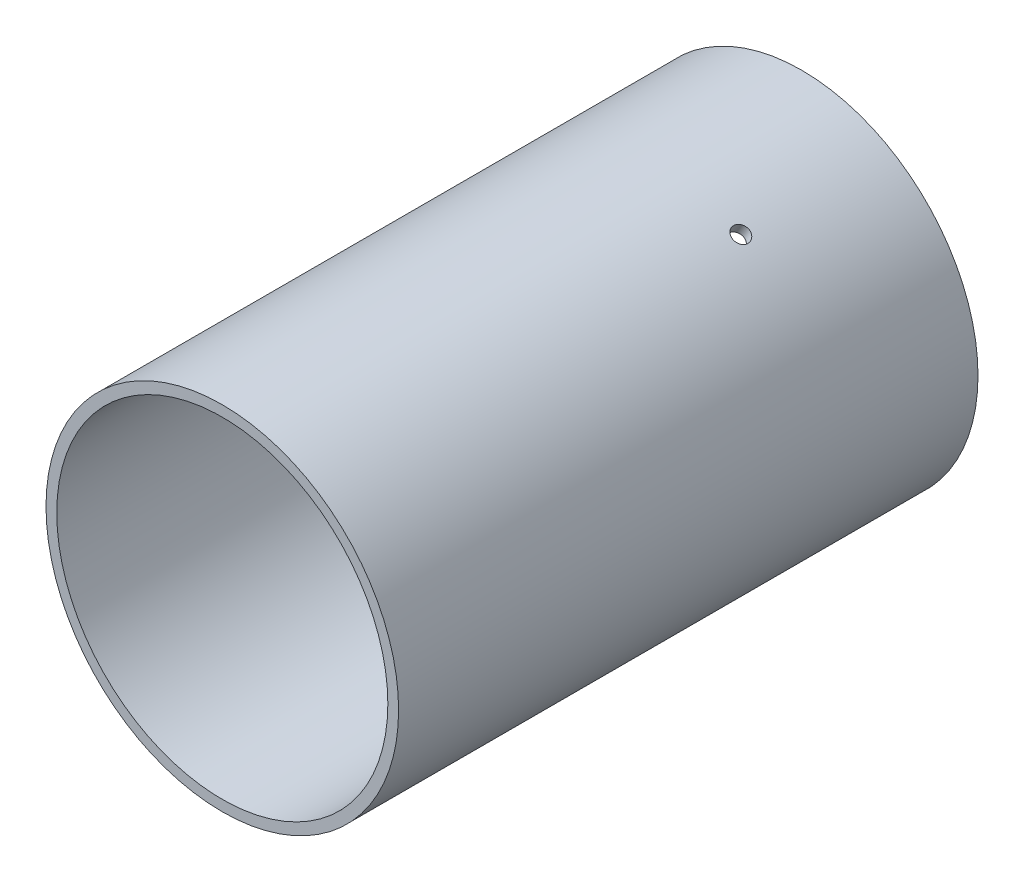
ISO-10303-21;
HEADER;
FILE_DESCRIPTION(('STEP AP214'),'2;1');
FILE_NAME('part.step','',(''),(''),'','','');
FILE_SCHEMA(('AUTOMOTIVE_DESIGN { 1 0 10303 214 1 1 1 1 }'));
ENDSEC;
DATA;
#1=APPLICATION_CONTEXT('core data for automotive mechanical design processes');
#2=APPLICATION_PROTOCOL_DEFINITION('international standard','automotive_design',2000,#1);
#3=PRODUCT_CONTEXT('',#1,'mechanical');
#4=PRODUCT('Part','Part','',(#3));
#5=PRODUCT_RELATED_PRODUCT_CATEGORY('part','',(#4));
#6=PRODUCT_DEFINITION_FORMATION('','',#4);
#7=PRODUCT_DEFINITION_CONTEXT('part definition',#1,'design');
#8=PRODUCT_DEFINITION('design','',#6,#7);
#9=PRODUCT_DEFINITION_SHAPE('','',#8);
#10=(LENGTH_UNIT() NAMED_UNIT(*) SI_UNIT(.MILLI.,.METRE.));
#11=(NAMED_UNIT(*) PLANE_ANGLE_UNIT() SI_UNIT($,.RADIAN.));
#12=(NAMED_UNIT(*) SI_UNIT($,.STERADIAN.) SOLID_ANGLE_UNIT());
#13=UNCERTAINTY_MEASURE_WITH_UNIT(LENGTH_MEASURE(1.E-05),#10,'distance_accuracy_value','');
#14=(GEOMETRIC_REPRESENTATION_CONTEXT(3) GLOBAL_UNCERTAINTY_ASSIGNED_CONTEXT((#13)) GLOBAL_UNIT_ASSIGNED_CONTEXT((#10,
#11,#12)) REPRESENTATION_CONTEXT('',''));
#15=CARTESIAN_POINT('',(0.,0.,0.));
#16=DIRECTION('',(0.,0.,1.));
#17=DIRECTION('',(1.,0.,0.));
#18=AXIS2_PLACEMENT_3D('',#15,#16,#17);
#19=CARTESIAN_POINT('',(0.,0.,88.9));
#20=DIRECTION('',(0.,0.,1.));
#21=DIRECTION('',(1.,0.,0.));
#22=AXIS2_PLACEMENT_3D('',#19,#20,#21);
#23=PLANE('',#22);
#24=CARTESIAN_POINT('',(0.,0.,88.9));
#25=DIRECTION('',(0.,0.,1.));
#26=DIRECTION('',(1.,0.,0.));
#27=AXIS2_PLACEMENT_3D('',#24,#25,#26);
#28=CIRCLE('',#27,27.051);
#29=CARTESIAN_POINT('',(27.051,0.,88.9));
#30=VERTEX_POINT('',#29);
#31=EDGE_CURVE('E10',#30,#30,#28,.T.);
#32=ORIENTED_EDGE('',*,*,#31,.T.);
#33=EDGE_LOOP('',(#32));
#34=FACE_BOUND('',#33,.T.);
#35=CARTESIAN_POINT('',(0.,0.,88.9));
#36=DIRECTION('',(0.,0.,1.));
#37=DIRECTION('',(1.,0.,0.));
#38=AXIS2_PLACEMENT_3D('',#35,#36,#37);
#39=CIRCLE('',#38,25.4);
#40=CARTESIAN_POINT('',(25.4,0.,88.9));
#41=VERTEX_POINT('',#40);
#42=EDGE_CURVE('E47',#41,#41,#39,.T.);
#43=ORIENTED_EDGE('',*,*,#42,.F.);
#44=EDGE_LOOP('',(#43));
#45=FACE_BOUND('',#44,.T.);
#46=ADVANCED_FACE('F29',(#34,#45),#23,.T.);
#47=CARTESIAN_POINT('',(0.,0.,0.));
#48=DIRECTION('',(0.,0.,1.));
#49=DIRECTION('',(1.,0.,0.));
#50=AXIS2_PLACEMENT_3D('',#47,#48,#49);
#51=PLANE('',#50);
#52=CARTESIAN_POINT('',(0.,0.,0.));
#53=DIRECTION('',(0.,0.,1.));
#54=DIRECTION('',(1.,0.,0.));
#55=AXIS2_PLACEMENT_3D('',#52,#53,#54);
#56=CIRCLE('',#55,27.051);
#57=CARTESIAN_POINT('',(27.051,0.,0.));
#58=VERTEX_POINT('',#57);
#59=EDGE_CURVE('E42',#58,#58,#56,.T.);
#60=ORIENTED_EDGE('',*,*,#59,.F.);
#61=EDGE_LOOP('',(#60));
#62=FACE_BOUND('',#61,.T.);
#63=CARTESIAN_POINT('',(0.,0.,0.));
#64=DIRECTION('',(0.,0.,1.));
#65=DIRECTION('',(1.,0.,0.));
#66=AXIS2_PLACEMENT_3D('',#63,#64,#65);
#67=CIRCLE('',#66,25.4);
#68=CARTESIAN_POINT('',(25.4,0.,0.));
#69=VERTEX_POINT('',#68);
#70=EDGE_CURVE('E78',#69,#69,#67,.T.);
#71=ORIENTED_EDGE('',*,*,#70,.T.);
#72=EDGE_LOOP('',(#71));
#73=FACE_BOUND('',#72,.T.);
#74=ADVANCED_FACE('F89',(#62,#73),#51,.F.);
#75=CARTESIAN_POINT('',(0.,0.,88.9));
#76=DIRECTION('',(0.,0.,-1.));
#77=DIRECTION('',(-1.,0.,0.));
#78=AXIS2_PLACEMENT_3D('',#75,#76,#77);
#79=CYLINDRICAL_SURFACE('',#78,27.051);
#80=CARTESIAN_POINT('',(14.6104379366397,22.7660208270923,22.86));
#81=CARTESIAN_POINT('',(14.6104354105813,22.7660227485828,22.9312942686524));
#82=CARTESIAN_POINT('',(14.6053639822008,22.7692795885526,23.0026392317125));
#83=CARTESIAN_POINT('',(14.5851930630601,22.7822053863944,23.1433613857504));
#84=CARTESIAN_POINT('',(14.5700817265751,22.7918819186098,23.2127361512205));
#85=CARTESIAN_POINT('',(14.5302293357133,22.8173090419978,23.3474590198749));
#86=CARTESIAN_POINT('',(14.5054931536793,22.8330565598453,23.4128091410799));
#87=CARTESIAN_POINT('',(14.4470471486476,22.870081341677,23.5376463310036));
#88=CARTESIAN_POINT('',(14.4133394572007,22.8913572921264,23.5971347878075));
#89=CARTESIAN_POINT('',(14.3378067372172,22.9387419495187,23.7086319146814));
#90=CARTESIAN_POINT('',(14.2959752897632,22.9648544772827,23.7606346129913));
#91=CARTESIAN_POINT('',(14.2053232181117,23.0210388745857,23.8556332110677));
#92=CARTESIAN_POINT('',(14.1565023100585,23.0511109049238,23.898628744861));
#93=CARTESIAN_POINT('',(14.0531624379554,23.1142572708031,23.9744082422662));
#94=CARTESIAN_POINT('',(13.9986409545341,23.1473329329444,24.0071876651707));
#95=CARTESIAN_POINT('',(13.8854061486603,23.215435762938,24.061575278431));
#96=CARTESIAN_POINT('',(13.8266928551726,23.2504629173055,24.0831835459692));
#97=CARTESIAN_POINT('',(13.7067462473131,23.3213755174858,24.1145999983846));
#98=CARTESIAN_POINT('',(13.6455148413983,23.3572603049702,24.1244169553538));
#99=CARTESIAN_POINT('',(13.5222123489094,23.4288594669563,24.1319991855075));
#100=CARTESIAN_POINT('',(13.4601412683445,23.4645738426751,24.1297645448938));
#101=CARTESIAN_POINT('',(13.3369774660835,23.5347967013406,24.1133143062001));
#102=CARTESIAN_POINT('',(13.275884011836,23.5693061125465,24.0991081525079));
#103=CARTESIAN_POINT('',(13.1563856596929,23.6362181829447,24.0591327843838));
#104=CARTESIAN_POINT('',(13.0979807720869,23.6686208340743,24.0333635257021));
#105=CARTESIAN_POINT('',(12.9855388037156,23.7304974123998,23.9709826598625));
#106=CARTESIAN_POINT('',(12.9315034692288,23.7599701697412,23.9343667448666));
#107=CARTESIAN_POINT('',(12.8294172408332,23.8152478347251,23.8513351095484));
#108=CARTESIAN_POINT('',(12.7813663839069,23.8410527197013,23.8049193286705));
#109=CARTESIAN_POINT('',(12.6926351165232,23.8884104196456,23.7035521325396));
#110=CARTESIAN_POINT('',(12.6519618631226,23.909959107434,23.6485925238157));
#111=CARTESIAN_POINT('',(12.579266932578,23.9482846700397,23.5317265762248));
#112=CARTESIAN_POINT('',(12.5472452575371,23.9650615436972,23.4698202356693));
#113=CARTESIAN_POINT('',(12.4928256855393,23.9934752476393,23.3408131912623));
#114=CARTESIAN_POINT('',(12.4704280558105,24.0051119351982,23.2737123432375));
#115=CARTESIAN_POINT('',(12.4359446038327,24.0229944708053,23.1362232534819));
#116=CARTESIAN_POINT('',(12.423858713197,24.0292403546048,23.0658350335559));
#117=CARTESIAN_POINT('',(12.4103776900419,24.036205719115,22.9238412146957));
#118=CARTESIAN_POINT('',(12.4089723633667,24.0369304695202,22.8522368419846));
#119=CARTESIAN_POINT('',(12.4168689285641,24.0328522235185,22.709780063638));
#120=CARTESIAN_POINT('',(12.4261707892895,24.0280492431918,22.6389276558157));
#121=CARTESIAN_POINT('',(12.4551884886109,24.013020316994,22.5000182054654));
#122=CARTESIAN_POINT('',(12.474899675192,24.002796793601,22.4319599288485));
#123=CARTESIAN_POINT('',(12.5241295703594,23.9771463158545,22.300532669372));
#124=CARTESIAN_POINT('',(12.5536483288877,23.9617193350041,22.2371637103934));
#125=CARTESIAN_POINT('',(12.6216225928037,23.9259840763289,22.1168611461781));
#126=CARTESIAN_POINT('',(12.6600848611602,23.9056721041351,22.0599324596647));
#127=CARTESIAN_POINT('',(12.7447750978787,23.8606287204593,21.9541759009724));
#128=CARTESIAN_POINT('',(12.7910031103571,23.8358972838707,21.9053480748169));
#129=CARTESIAN_POINT('',(12.8898844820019,23.7825698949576,21.8171408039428));
#130=CARTESIAN_POINT('',(12.9425428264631,23.753970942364,21.7777687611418));
#131=CARTESIAN_POINT('',(13.0526979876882,23.6936197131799,21.7096412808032));
#132=CARTESIAN_POINT('',(13.1101947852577,23.6618674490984,21.6808858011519));
#133=CARTESIAN_POINT('',(13.2283178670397,23.5960330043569,21.634820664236));
#134=CARTESIAN_POINT('',(13.2889428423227,23.5619517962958,21.6175062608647));
#135=CARTESIAN_POINT('',(13.4115877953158,23.4923579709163,21.5947992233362));
#136=CARTESIAN_POINT('',(13.473607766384,23.4568453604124,21.5894065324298));
#137=CARTESIAN_POINT('',(13.5972077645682,23.3854149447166,21.5906965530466));
#138=CARTESIAN_POINT('',(13.6587881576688,23.3494975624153,21.5973676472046));
#139=CARTESIAN_POINT('',(13.7798343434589,23.278266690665,21.6225718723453));
#140=CARTESIAN_POINT('',(13.8393001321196,23.2429532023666,21.641105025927));
#141=CARTESIAN_POINT('',(13.9544671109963,23.1739931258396,21.6895049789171));
#142=CARTESIAN_POINT('',(14.0101682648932,23.1403465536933,21.719371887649));
#143=CARTESIAN_POINT('',(14.1162816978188,23.0757676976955,21.789589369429));
#144=CARTESIAN_POINT('',(14.1666941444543,23.044835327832,21.8299396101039));
#145=CARTESIAN_POINT('',(14.2609148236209,22.9866479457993,21.9200193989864));
#146=CARTESIAN_POINT('',(14.3047173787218,22.9593960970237,21.9697569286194));
#147=CARTESIAN_POINT('',(14.3845085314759,22.9094900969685,22.077196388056));
#148=CARTESIAN_POINT('',(14.420495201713,22.8868370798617,22.1349002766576));
#149=CARTESIAN_POINT('',(14.4837163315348,22.8468808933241,22.2566755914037));
#150=CARTESIAN_POINT('',(14.5109428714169,22.8295825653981,22.3207527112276));
#151=CARTESIAN_POINT('',(14.5558572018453,22.8009723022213,22.4533665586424));
#152=CARTESIAN_POINT('',(14.5735562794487,22.789653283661,22.5218979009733));
#153=CARTESIAN_POINT('',(14.5943032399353,22.7763692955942,22.6357136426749));
#154=CARTESIAN_POINT('',(14.6003465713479,22.7724944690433,22.6802605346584));
#155=CARTESIAN_POINT('',(14.6084147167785,22.7673196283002,22.7698648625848));
#156=CARTESIAN_POINT('',(14.6104395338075,22.7660196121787,22.8149222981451));
#157=CARTESIAN_POINT('',(14.6104379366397,22.7660208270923,22.86));
#158=B_SPLINE_CURVE_WITH_KNOTS('',3,(#80,#81,#82,#83,#84,#85,#86,#87,#88,#89,#90,#91,#92,#93,
#94,#95,#96,#97,#98,#99,#100,#101,#102,#103,#104,#105,#106,#107,#108,#109,#110,#111,#112,#113,
#114,#115,#116,#117,#118,#119,#120,#121,#122,#123,#124,#125,#126,#127,#128,#129,#130,#131,#132,
#133,#134,#135,#136,#137,#138,#139,#140,#141,#142,#143,#144,#145,#146,#147,#148,#149,#150,#151,
#152,#153,#154,#155,#156,#157),.UNSPECIFIED.,.T.,.F.,(4,2,2,2,2,2,2,2,2,2,2,2,2,2,2,2,2,2,2,2,2,
2,2,2,2,2,2,2,2,2,2,2,2,2,2,2,2,2,4),(0.,0.213718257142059,0.427689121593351,0.641551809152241,
0.855363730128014,1.06934528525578,1.28333553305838,1.49742075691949,1.71150450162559,
1.92542888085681,2.13935172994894,2.35310597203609,2.56686103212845,2.78070110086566,
2.99454249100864,3.20859023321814,3.42263802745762,3.63669176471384,3.85074408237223,
4.06459207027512,4.27843943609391,4.49219131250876,4.70594427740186,4.91985940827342,
5.13377575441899,5.34785901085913,5.56194141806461,5.77593496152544,5.9899274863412,
6.20371404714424,6.41750101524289,6.63129004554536,6.8450722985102,7.05903714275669,
7.27305469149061,7.48726518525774,7.70122134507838,7.83635051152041,7.97147957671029),.UNSPECIFIED.);
#159=CARTESIAN_POINT('',(14.6104379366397,22.7660208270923,22.86));
#160=VERTEX_POINT('',#159);
#161=EDGE_CURVE('E118',#160,#160,#158,.T.);
#162=ORIENTED_EDGE('',*,*,#161,.T.);
#163=EDGE_LOOP('',(#162));
#164=FACE_BOUND('',#163,.T.);
#165=CARTESIAN_POINT('',(12.4107334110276,-24.0360208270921,22.86));
#166=CARTESIAN_POINT('',(12.4107363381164,-24.0360196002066,22.9312942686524));
#167=CARTESIAN_POINT('',(12.4160925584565,-24.0332560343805,23.0026392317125));
#168=CARTESIAN_POINT('',(12.4373720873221,-24.0222504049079,23.1433613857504));
#169=CARTESIAN_POINT('',(12.4533078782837,-24.0140018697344,23.2127361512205));
#170=CARTESIAN_POINT('',(12.4952546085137,-23.9922022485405,23.3474590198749));
#171=CARTESIAN_POINT('',(12.5212604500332,-23.9786538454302,23.4128091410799));
#172=CARTESIAN_POINT('',(12.5825478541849,-23.9465505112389,23.5376463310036));
#173=CARTESIAN_POINT('',(12.6178272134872,-23.9279967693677,23.5971347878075));
#174=CARTESIAN_POINT('',(12.6966298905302,-23.8862758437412,23.7086319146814));
#175=CARTESIAN_POINT('',(12.7401597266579,-23.863105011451,23.7606346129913));
#176=CARTESIAN_POINT('',(12.8341428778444,-23.8126902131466,23.8556332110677));
#177=CARTESIAN_POINT('',(12.8845964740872,-23.7854460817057,23.898628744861));
#178=CARTESIAN_POINT('',(12.9909527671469,-23.7275243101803,23.9744082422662));
#179=CARTESIAN_POINT('',(13.0468578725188,-23.696845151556,24.0071876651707));
#180=CARTESIAN_POINT('',(13.1624540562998,-23.6328323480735,24.061575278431));
#181=CARTESIAN_POINT('',(13.2221451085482,-23.5994987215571,24.0831835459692));
#182=CARTESIAN_POINT('',(13.3435305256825,-23.5310782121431,24.1145999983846));
#183=CARTESIAN_POINT('',(13.4052233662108,-23.4959926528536,24.1244169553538));
#184=CARTESIAN_POINT('',(13.5288813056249,-23.4250091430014,24.1319991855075));
#185=CARTESIAN_POINT('',(13.5908464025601,-23.3891111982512,24.1297645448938));
#186=CARTESIAN_POINT('',(13.7132430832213,-23.3175596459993,24.1133143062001));
#187=CARTESIAN_POINT('',(13.773675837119,-23.2819058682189,24.0991081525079));
#188=CARTESIAN_POINT('',(13.8913725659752,-23.2118732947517,24.0591327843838));
#189=CARTESIAN_POINT('',(13.9486365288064,-23.1774945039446,24.0333635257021));
#190=CARTESIAN_POINT('',(14.0584442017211,-23.1110551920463,23.9709826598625));
#191=CARTESIAN_POINT('',(14.1109860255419,-23.0789955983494,23.9343667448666));
#192=CARTESIAN_POINT('',(14.2099010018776,-23.0182251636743,23.8513351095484));
#193=CARTESIAN_POINT('',(14.2562741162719,-22.9895143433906,23.8049193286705));
#194=CARTESIAN_POINT('',(14.3416527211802,-22.9363496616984,23.7035521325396));
#195=CARTESIAN_POINT('',(14.3806510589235,-22.9118999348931,23.6485925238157));
#196=CARTESIAN_POINT('',(14.4501894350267,-22.8681070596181,23.5317265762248));
#197=CARTESIAN_POINT('',(14.4807294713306,-22.8487639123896,23.4698202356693));
#198=CARTESIAN_POINT('',(14.532546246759,-22.8158420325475,23.3408131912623));
#199=CARTESIAN_POINT('',(14.5538227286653,-22.8022634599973,23.2737123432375));
#200=CARTESIAN_POINT('',(14.586551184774,-22.7813411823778,23.1362232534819));
#201=CARTESIAN_POINT('',(14.5980032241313,-22.7739974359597,23.0658350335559));
#202=CARTESIAN_POINT('',(14.6107759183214,-22.7658052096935,22.9238412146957));
#203=CARTESIAN_POINT('',(14.6121062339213,-22.7649505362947,22.8522368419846));
#204=CARTESIAN_POINT('',(14.6046260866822,-22.7697500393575,22.709780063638));
#205=CARTESIAN_POINT('',(14.5958156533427,-22.7754041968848,22.6389276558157));
#206=CARTESIAN_POINT('',(14.5682913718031,-22.7930197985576,22.5000182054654));
#207=CARTESIAN_POINT('',(14.549581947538,-22.804978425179,22.4319599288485));
#208=CARTESIAN_POINT('',(14.5027530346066,-22.8347875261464,22.300532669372));
#209=CARTESIAN_POINT('',(14.4746334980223,-22.8526380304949,22.2371637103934));
#210=CARTESIAN_POINT('',(14.4096987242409,-22.8936378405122,22.1168611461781));
#211=CARTESIAN_POINT('',(14.3728769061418,-22.9167911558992,22.0599324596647));
#212=CARTESIAN_POINT('',(14.2915230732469,-22.967613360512,21.9541759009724));
#213=CARTESIAN_POINT('',(14.2469910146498,-22.9952822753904,21.9053480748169));
#214=CARTESIAN_POINT('',(14.1513674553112,-23.0542523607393,21.8171408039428));
#215=CARTESIAN_POINT('',(14.100270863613,-23.0855563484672,21.7777687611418));
#216=CARTESIAN_POINT('',(13.9929275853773,-23.150777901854,21.7096412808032));
#217=CARTESIAN_POINT('',(13.9366809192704,-23.1846954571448,21.6808858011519));
#218=CARTESIAN_POINT('',(13.8206050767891,-23.2540758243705,21.634820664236));
#219=CARTESIAN_POINT('',(13.7607773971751,-23.2895379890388,21.6175062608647));
#220=CARTESIAN_POINT('',(13.6391848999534,-23.360954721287,21.5947992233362));
#221=CARTESIAN_POINT('',(13.5774200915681,-23.3969092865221,21.5894065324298));
#222=CARTESIAN_POINT('',(13.4537595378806,-23.4682348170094,21.5906965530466));
#223=CARTESIAN_POINT('',(13.39186397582,-23.5036063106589,21.5973676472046));
#224=CARTESIAN_POINT('',(13.2696531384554,-23.5728199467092,21.6225718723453));
#225=CARTESIAN_POINT('',(13.2093378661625,-23.6066620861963,21.641105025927));
#226=CARTESIAN_POINT('',(13.0920331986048,-23.6719195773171,21.6895049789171));
#227=CARTESIAN_POINT('',(13.0350438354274,-23.7033349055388,21.719371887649));
#228=CARTESIAN_POINT('',(12.9260601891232,-23.7629424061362,21.789589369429));
#229=CARTESIAN_POINT('',(12.8740657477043,-23.7911346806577,21.8299396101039));
#230=CARTESIAN_POINT('',(12.776563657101,-23.8436384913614,21.9200193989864));
#231=CARTESIAN_POINT('',(12.7310615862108,-23.8679466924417,21.9697569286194));
#232=CARTESIAN_POINT('',(12.6479461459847,-23.9120948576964,22.077196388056));
#233=CARTESIAN_POINT('',(12.6103347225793,-23.9319337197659,22.1349002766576));
#234=CARTESIAN_POINT('',(12.5441210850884,-23.9667067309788,22.2566755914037));
#235=CARTESIAN_POINT('',(12.5155270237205,-23.9816364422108,22.3207527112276));
#236=CARTESIAN_POINT('',(12.4682926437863,-24.0062282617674,22.4533665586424));
#237=CARTESIAN_POINT('',(12.4496405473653,-24.0158966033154,22.5218979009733));
#238=CARTESIAN_POINT('',(12.4277627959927,-24.0272220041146,22.6357136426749));
#239=CARTESIAN_POINT('',(12.4213854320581,-24.030518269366,22.6802605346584));
#240=CARTESIAN_POINT('',(12.4128698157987,-24.0349180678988,22.7698648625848));
#241=CARTESIAN_POINT('',(12.4107315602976,-24.0360216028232,22.8149222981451));
#242=CARTESIAN_POINT('',(12.4107334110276,-24.0360208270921,22.86));
#243=B_SPLINE_CURVE_WITH_KNOTS('',3,(#165,#166,#167,#168,#169,#170,#171,#172,#173,#174,#175,
#176,#177,#178,#179,#180,#181,#182,#183,#184,#185,#186,#187,#188,#189,#190,#191,#192,#193,#194,
#195,#196,#197,#198,#199,#200,#201,#202,#203,#204,#205,#206,#207,#208,#209,#210,#211,#212,#213,
#214,#215,#216,#217,#218,#219,#220,#221,#222,#223,#224,#225,#226,#227,#228,#229,#230,#231,#232,
#233,#234,#235,#236,#237,#238,#239,#240,#241,#242),.UNSPECIFIED.,.T.,.F.,(4,2,2,2,2,2,2,2,2,2,2,
2,2,2,2,2,2,2,2,2,2,2,2,2,2,2,2,2,2,2,2,2,2,2,2,2,2,2,4),(0.,0.213718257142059,
0.427689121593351,0.641551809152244,0.855363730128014,1.06934528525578,1.28333553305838,
1.49742075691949,1.71150450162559,1.92542888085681,2.13935172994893,2.35310597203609,
2.56686103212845,2.78070110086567,2.99454249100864,3.20859023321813,3.42263802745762,
3.63669176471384,3.85074408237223,4.06459207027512,4.27843943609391,4.49219131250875,
4.70594427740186,4.91985940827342,5.13377575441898,5.34785901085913,5.56194141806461,
5.77593496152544,5.98992748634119,6.20371404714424,6.41750101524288,6.63129004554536,
6.8450722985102,7.05903714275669,7.27305469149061,7.48726518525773,7.70122134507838,
7.8363505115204,7.97147957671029),.UNSPECIFIED.);
#244=CARTESIAN_POINT('',(12.4107334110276,-24.0360208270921,22.86));
#245=VERTEX_POINT('',#244);
#246=EDGE_CURVE('E57',#245,#245,#243,.T.);
#247=ORIENTED_EDGE('',*,*,#246,.T.);
#248=EDGE_LOOP('',(#247));
#249=FACE_BOUND('',#248,.T.);
#250=CARTESIAN_POINT('',(-27.051,0.,21.59));
#251=CARTESIAN_POINT('',(-27.0509996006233,0.0712943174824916,21.5900031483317));
#252=CARTESIAN_POINT('',(-27.0507151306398,0.142639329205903,21.5960235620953));
#253=CARTESIAN_POINT('',(-27.0496076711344,0.283361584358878,21.6199550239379));
#254=CARTESIAN_POINT('',(-27.0487840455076,0.352736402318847,21.6378801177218));
#255=CARTESIAN_POINT('',(-27.0466915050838,0.487459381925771,21.6851069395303));
#256=CARTESIAN_POINT('',(-27.0454228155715,0.552809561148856,21.7144029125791));
#257=CARTESIAN_POINT('',(-27.0425830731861,0.677646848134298,21.7835311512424));
#258=CARTESIAN_POINT('',(-27.0410120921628,0.737135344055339,21.823360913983));
#259=CARTESIAN_POINT('',(-27.0377429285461,0.848632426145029,21.9124665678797));
#260=CARTESIAN_POINT('',(-27.0360446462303,0.900635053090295,21.9617499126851));
#261=CARTESIAN_POINT('',(-27.0327131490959,0.99563351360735,22.0683490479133));
#262=CARTESIAN_POINT('',(-27.0310799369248,1.03862898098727,22.1256651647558));
#263=CARTESIAN_POINT('',(-27.0280620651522,1.1144084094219,22.2467332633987));
#264=CARTESIAN_POINT('',(-27.0266775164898,1.14718781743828,22.3104880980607));
#265=CARTESIAN_POINT('',(-27.024314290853,1.20157539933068,22.4426037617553));
#266=CARTESIAN_POINT('',(-27.0233356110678,1.22318365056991,22.5109645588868));
#267=CARTESIAN_POINT('',(-27.0218953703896,1.2546000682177,22.6502977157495));
#268=CARTESIAN_POINT('',(-27.0214334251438,1.26441700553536,22.7212680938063));
#269=CARTESIAN_POINT('',(-27.0210775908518,1.27199918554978,22.8638508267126));
#270=CARTESIAN_POINT('',(-27.0211836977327,1.26976451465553,22.9354631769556));
#271=CARTESIAN_POINT('',(-27.0219516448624,1.25331422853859,23.0772374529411));
#272=CARTESIAN_POINT('',(-27.0226130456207,1.23910808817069,23.1474004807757));
#273=CARTESIAN_POINT('',(-27.0244163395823,1.19913280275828,23.2843448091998));
#274=CARTESIAN_POINT('',(-27.0255582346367,1.1733636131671,23.3511260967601));
#275=CARTESIAN_POINT('',(-27.0281943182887,1.11098288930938,23.4794418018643));
#276=CARTESIAN_POINT('',(-27.0296886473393,1.07436703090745,23.5409741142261));
#277=CARTESIAN_POINT('',(-27.0328610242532,0.991335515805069,23.657022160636));
#278=CARTESIAN_POINT('',(-27.0345390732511,0.944919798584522,23.7115378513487));
#279=CARTESIAN_POINT('',(-27.0378917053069,0.843552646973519,23.8120603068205));
#280=CARTESIAN_POINT('',(-27.0395662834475,0.788593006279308,23.8580587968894));
#281=CARTESIAN_POINT('',(-27.042721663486,0.671726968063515,23.9401773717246));
#282=CARTESIAN_POINT('',(-27.0442024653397,0.60982056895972,23.976297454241));
#283=CARTESIAN_POINT('',(-27.04680345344,0.480813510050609,24.0376330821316));
#284=CARTESIAN_POINT('',(-27.0479236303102,0.413712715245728,24.062848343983));
#285=CARTESIAN_POINT('',(-27.0496769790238,0.276223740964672,24.1016531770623));
#286=CARTESIAN_POINT('',(-27.0503101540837,0.20583558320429,24.1152428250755));
#287=CARTESIAN_POINT('',(-27.0510177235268,0.063841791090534,24.1304004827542));
#288=CARTESIAN_POINT('',(-27.0510926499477,-0.00776261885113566,24.1319799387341));
#289=CARTESIAN_POINT('',(-27.0506766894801,-0.150219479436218,24.1231022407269));
#290=CARTESIAN_POINT('',(-27.0501858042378,-0.221071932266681,24.1126451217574));
#291=CARTESIAN_POINT('',(-27.048693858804,-0.359981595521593,24.0800005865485));
#292=CARTESIAN_POINT('',(-27.047693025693,-0.428040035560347,24.0578183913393));
#293=CARTESIAN_POINT('',(-27.0452938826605,-0.559467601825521,24.0023586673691));
#294=CARTESIAN_POINT('',(-27.0438955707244,-0.622836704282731,23.9690810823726));
#295=CARTESIAN_POINT('',(-27.0408574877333,-0.743139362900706,23.8923458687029));
#296=CARTESIAN_POINT('',(-27.0392175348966,-0.800068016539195,23.848880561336));
#297=CARTESIAN_POINT('',(-27.0358814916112,-0.905824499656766,23.7530149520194));
#298=CARTESIAN_POINT('',(-27.0341854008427,-0.95465228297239,23.7006145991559));
#299=CARTESIAN_POINT('',(-27.0309267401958,-1.04285946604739,23.5883171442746));
#300=CARTESIAN_POINT('',(-27.0293642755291,-1.08223146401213,23.5284142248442));
#301=CARTESIAN_POINT('',(-27.0265507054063,-1.15035886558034,23.4028414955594));
#302=CARTESIAN_POINT('',(-27.0252995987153,-1.17911431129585,23.3371717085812));
#303=CARTESIAN_POINT('',(-27.0232505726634,-1.22517942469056,23.2019568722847));
#304=CARTESIAN_POINT('',(-27.0224524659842,-1.24249382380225,23.1324134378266));
#305=CARTESIAN_POINT('',(-27.0213989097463,-1.26520083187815,22.9914027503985));
#306=CARTESIAN_POINT('',(-27.0211434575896,-1.27059349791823,22.9199355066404));
#307=CARTESIAN_POINT('',(-27.0212040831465,-1.26930340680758,22.7771796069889));
#308=CARTESIAN_POINT('',(-27.02151960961,-1.26263229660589,22.7058908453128));
#309=CARTESIAN_POINT('',(-27.0226854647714,-1.23742807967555,22.565446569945));
#310=CARTESIAN_POINT('',(-27.0235357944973,-1.21889495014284,22.4962910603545));
#311=CARTESIAN_POINT('',(-27.0256752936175,-1.17049508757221,22.3620737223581));
#312=CARTESIAN_POINT('',(-27.0269644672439,-1.14062824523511,22.2970119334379));
#313=CARTESIAN_POINT('',(-27.0298363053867,-1.07041093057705,22.1728257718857));
#314=CARTESIAN_POINT('',(-27.0314189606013,-1.03006079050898,22.1137012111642));
#315=CARTESIAN_POINT('',(-27.0347011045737,-0.939981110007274,22.0030100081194));
#316=CARTESIAN_POINT('',(-27.0364006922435,-0.890243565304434,21.9514498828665));
#317=CARTESIAN_POINT('',(-27.0397244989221,-0.782804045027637,21.8573955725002));
#318=CARTESIAN_POINT('',(-27.0413486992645,-0.725100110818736,21.8149036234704));
#319=CARTESIAN_POINT('',(-27.0443397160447,-0.603324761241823,21.7401743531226));
#320=CARTESIAN_POINT('',(-27.0457062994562,-0.539247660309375,21.7079462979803));
#321=CARTESIAN_POINT('',(-27.0480245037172,-0.406633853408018,21.6547441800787));
#322=CARTESIAN_POINT('',(-27.0489766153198,-0.338102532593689,21.6337568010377));
#323=CARTESIAN_POINT('',(-27.0501062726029,-0.224286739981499,21.609147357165));
#324=CARTESIAN_POINT('',(-27.0504399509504,-0.179739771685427,21.6019762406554));
#325=CARTESIAN_POINT('',(-27.0508869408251,-0.0901352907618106,21.5924015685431));
#326=CARTESIAN_POINT('',(-27.0510002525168,-0.0450777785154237,21.5899980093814));
#327=CARTESIAN_POINT('',(-27.051,0.,21.59));
#328=B_SPLINE_CURVE_WITH_KNOTS('',3,(#250,#251,#252,#253,#254,#255,#256,#257,#258,#259,#260,
#261,#262,#263,#264,#265,#266,#267,#268,#269,#270,#271,#272,#273,#274,#275,#276,#277,#278,#279,
#280,#281,#282,#283,#284,#285,#286,#287,#288,#289,#290,#291,#292,#293,#294,#295,#296,#297,#298,
#299,#300,#301,#302,#303,#304,#305,#306,#307,#308,#309,#310,#311,#312,#313,#314,#315,#316,#317,
#318,#319,#320,#321,#322,#323,#324,#325,#326,#327),.UNSPECIFIED.,.T.,.F.,(4,2,2,2,2,2,2,2,2,2,2,
2,2,2,2,2,2,2,2,2,2,2,2,2,2,2,2,2,2,2,2,2,2,2,2,2,2,2,4),(0.,0.213718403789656,
0.427689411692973,0.641552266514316,0.855364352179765,1.0693457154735,1.28333577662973,
1.49742107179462,1.71150488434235,1.92542935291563,2.13935228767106,2.35310607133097,
2.56686067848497,2.78070061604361,2.99454187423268,3.20858980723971,3.42263778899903,
3.63669133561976,3.85074346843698,4.0645915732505,4.27843905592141,4.49219139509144,
4.70594481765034,4.9198598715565,5.13377614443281,5.34785932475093,5.56194165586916,
5.77593539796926,5.98992811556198,6.20371434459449,6.41750098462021,6.63128968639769,
6.84507161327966,7.05903665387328,7.27305439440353,7.4872648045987,7.70122088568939,
7.83635028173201,7.97147957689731),.UNSPECIFIED.);
#329=CARTESIAN_POINT('',(-27.051,0.,21.59));
#330=VERTEX_POINT('',#329);
#331=EDGE_CURVE('E56',#330,#330,#328,.T.);
#332=ORIENTED_EDGE('',*,*,#331,.T.);
#333=EDGE_LOOP('',(#332));
#334=FACE_BOUND('',#333,.T.);
#335=ORIENTED_EDGE('',*,*,#31,.F.);
#336=EDGE_LOOP('',(#335));
#337=FACE_BOUND('',#336,.T.);
#338=ORIENTED_EDGE('',*,*,#59,.T.);
#339=EDGE_LOOP('',(#338));
#340=FACE_BOUND('',#339,.T.);
#341=ADVANCED_FACE('F31',(#164,#249,#334,#337,#340),#79,.T.);
#342=CARTESIAN_POINT('',(0.,0.,88.9));
#343=DIRECTION('',(0.,0.,-1.));
#344=DIRECTION('',(-1.,0.,0.));
#345=AXIS2_PLACEMENT_3D('',#342,#343,#344);
#346=CYLINDRICAL_SURFACE('',#345,25.4);
#347=CARTESIAN_POINT('',(13.7839673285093,21.334531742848,22.86));
#348=CARTESIAN_POINT('',(13.7839648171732,21.33453368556,22.9312886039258));
#349=CARTESIAN_POINT('',(13.7789034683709,21.3378060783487,23.0026277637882));
#350=CARTESIAN_POINT('',(13.7587720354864,21.3507922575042,23.1433380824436));
#351=CARTESIAN_POINT('',(13.7436901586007,21.3605136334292,23.2127068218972));
#352=CARTESIAN_POINT('',(13.7039133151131,21.3860542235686,23.3474176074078));
#353=CARTESIAN_POINT('',(13.6792232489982,21.4018703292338,23.4127616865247));
#354=CARTESIAN_POINT('',(13.6208814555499,21.4390479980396,23.537587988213));
#355=CARTESIAN_POINT('',(13.5872318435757,21.4604082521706,23.5970715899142));
#356=CARTESIAN_POINT('',(13.5118176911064,21.5079698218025,23.7085663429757));
#357=CARTESIAN_POINT('',(13.4700459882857,21.5341754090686,23.7605708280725));
#358=CARTESIAN_POINT('',(13.379511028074,21.590542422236,23.8555743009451));
#359=CARTESIAN_POINT('',(13.3307474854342,21.6207040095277,23.8985729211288));
#360=CARTESIAN_POINT('',(13.2275101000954,21.6840180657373,23.9743623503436));
#361=CARTESIAN_POINT('',(13.1730333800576,21.7171720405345,24.0071479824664));
#362=CARTESIAN_POINT('',(13.0598731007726,21.7854096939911,24.0615475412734));
#363=CARTESIAN_POINT('',(13.0011895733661,21.8204933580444,24.0831615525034));
#364=CARTESIAN_POINT('',(12.8812901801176,21.8914871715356,24.1145867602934));
#365=CARTESIAN_POINT('',(12.8200764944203,21.9273965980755,24.1244079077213));
#366=CARTESIAN_POINT('',(12.6967902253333,21.9990135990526,24.131999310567));
#367=CARTESIAN_POINT('',(12.6347176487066,22.0347211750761,24.1297696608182));
#368=CARTESIAN_POINT('',(12.5115389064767,22.1048957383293,24.1133310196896));
#369=CARTESIAN_POINT('',(12.4504319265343,22.139363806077,24.0991327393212));
#370=CARTESIAN_POINT('',(12.3308898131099,22.2061668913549,24.0591764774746));
#371=CARTESIAN_POINT('',(12.2724546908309,22.2385018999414,24.0334184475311));
#372=CARTESIAN_POINT('',(12.1599359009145,22.3002260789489,23.971061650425));
#373=CARTESIAN_POINT('',(12.105854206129,22.3296139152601,23.9344580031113));
#374=CARTESIAN_POINT('',(12.0036669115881,22.3847125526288,23.8514525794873));
#375=CARTESIAN_POINT('',(11.9555613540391,22.4104233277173,23.8050507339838));
#376=CARTESIAN_POINT('',(11.866711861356,22.4575975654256,23.7037055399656));
#377=CARTESIAN_POINT('',(11.82597604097,22.4790563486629,23.6487528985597));
#378=CARTESIAN_POINT('',(11.7531610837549,22.5172134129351,23.5318986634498));
#379=CARTESIAN_POINT('',(11.721081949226,22.533911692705,23.4699970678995));
#380=CARTESIAN_POINT('',(11.6665583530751,22.562188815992,23.3409964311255));
#381=CARTESIAN_POINT('',(11.6441142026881,22.573767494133,23.273897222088));
#382=CARTESIAN_POINT('',(11.6095537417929,22.591561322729,23.1364086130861));
#383=CARTESIAN_POINT('',(11.5974373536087,22.5977765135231,23.0660192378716));
#384=CARTESIAN_POINT('',(11.5839152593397,22.6047111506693,22.9240299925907));
#385=CARTESIAN_POINT('',(11.5824979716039,22.6054365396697,22.8524315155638));
#386=CARTESIAN_POINT('',(11.5903874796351,22.6013923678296,22.7099847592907));
#387=CARTESIAN_POINT('',(11.5996942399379,22.5966228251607,22.6391364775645));
#388=CARTESIAN_POINT('',(11.6287359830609,22.5816908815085,22.5002377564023));
#389=CARTESIAN_POINT('',(11.6484656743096,22.5715312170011,22.432185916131));
#390=CARTESIAN_POINT('',(11.6977429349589,22.5460323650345,22.3007686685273));
#391=CARTESIAN_POINT('',(11.727290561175,22.5306931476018,22.2374032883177));
#392=CARTESIAN_POINT('',(11.7953318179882,22.4951465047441,22.1170978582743));
#393=CARTESIAN_POINT('',(11.8338331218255,22.4749349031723,22.0601633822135));
#394=CARTESIAN_POINT('',(11.9186037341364,22.4300953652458,21.9543919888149));
#395=CARTESIAN_POINT('',(11.9648730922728,22.4054674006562,21.9055551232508));
#396=CARTESIAN_POINT('',(12.0638395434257,22.352336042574,21.8173215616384));
#397=CARTESIAN_POINT('',(12.1165422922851,22.3238292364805,21.7779332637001));
#398=CARTESIAN_POINT('',(12.2267795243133,22.2636430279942,21.7097723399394));
#399=CARTESIAN_POINT('',(12.2843139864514,22.2319636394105,21.680999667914));
#400=CARTESIAN_POINT('',(12.4024979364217,22.1662493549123,21.634901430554));
#401=CARTESIAN_POINT('',(12.4631459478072,22.1322155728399,21.6175704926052));
#402=CARTESIAN_POINT('',(12.5858223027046,22.062684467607,21.5948300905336));
#403=CARTESIAN_POINT('',(12.6478506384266,22.0271871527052,21.5894205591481));
#404=CARTESIAN_POINT('',(12.7714432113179,21.9557584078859,21.590677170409));
#405=CARTESIAN_POINT('',(12.8330078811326,21.9198274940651,21.5973301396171));
#406=CARTESIAN_POINT('',(12.9540078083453,21.8485380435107,21.6224956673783));
#407=CARTESIAN_POINT('',(13.0134430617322,21.8131795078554,21.6410082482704));
#408=CARTESIAN_POINT('',(13.1285374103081,21.7441029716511,21.6893648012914));
#409=CARTESIAN_POINT('',(13.1841964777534,21.7103849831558,21.7192088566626));
#410=CARTESIAN_POINT('',(13.290219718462,21.6456444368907,21.789378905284));
#411=CARTESIAN_POINT('',(13.3405840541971,21.6146217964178,21.8297045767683));
#412=CARTESIAN_POINT('',(13.4347149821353,21.5562406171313,21.9197403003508));
#413=CARTESIAN_POINT('',(13.4784750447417,21.5288857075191,21.9694595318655));
#414=CARTESIAN_POINT('',(13.5581862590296,21.4787757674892,22.0768650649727));
#415=CARTESIAN_POINT('',(13.5941354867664,21.4560218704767,22.1345533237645));
#416=CARTESIAN_POINT('',(13.6572943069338,21.4158753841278,22.2563047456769));
#417=CARTESIAN_POINT('',(13.6844954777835,21.3984879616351,22.3203739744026));
#418=CARTESIAN_POINT('',(13.72937309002,21.3697223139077,22.4529771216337));
#419=CARTESIAN_POINT('',(13.7470607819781,21.3583369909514,22.521505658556));
#420=CARTESIAN_POINT('',(13.7678139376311,21.3449615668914,22.6353833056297));
#421=CARTESIAN_POINT('',(13.7738642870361,21.3410563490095,22.6799948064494));
#422=CARTESIAN_POINT('',(13.7819417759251,21.3358408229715,22.7697307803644));
#423=CARTESIAN_POINT('',(13.7839689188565,21.3345305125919,22.8148552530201));
#424=CARTESIAN_POINT('',(13.7839673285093,21.334531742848,22.86));
#425=B_SPLINE_CURVE_WITH_KNOTS('',3,(#347,#348,#349,#350,#351,#352,#353,#354,#355,#356,#357,
#358,#359,#360,#361,#362,#363,#364,#365,#366,#367,#368,#369,#370,#371,#372,#373,#374,#375,#376,
#377,#378,#379,#380,#381,#382,#383,#384,#385,#386,#387,#388,#389,#390,#391,#392,#393,#394,#395,
#396,#397,#398,#399,#400,#401,#402,#403,#404,#405,#406,#407,#408,#409,#410,#411,#412,#413,#414,
#415,#416,#417,#418,#419,#420,#421,#422,#423,#424),.UNSPECIFIED.,.T.,.F.,(4,2,2,2,2,2,2,2,2,2,2,
2,2,2,2,2,2,2,2,2,2,2,2,2,2,2,2,2,2,2,2,2,2,2,2,2,2,2,4),(0.,0.213701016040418,
0.427653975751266,0.641497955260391,0.85529149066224,1.06927441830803,1.28326607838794,
1.49736603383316,1.71146436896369,1.9253819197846,2.13929778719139,2.35302241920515,
2.56674794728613,2.78056979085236,2.99439314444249,3.20845052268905,3.42250795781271,
3.6365723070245,3.85063504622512,4.06446603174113,4.278296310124,4.49201813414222,
4.70574119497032,4.91964809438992,5.13355636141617,5.34765405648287,5.56175081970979,
5.77574697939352,5.98974193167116,6.20350332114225,6.41726511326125,6.63102847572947,
6.84478527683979,7.05875205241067,7.27277147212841,7.48699631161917,7.70096725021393,
7.83629724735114,7.97162712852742),.UNSPECIFIED.);
#426=CARTESIAN_POINT('',(13.7839673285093,21.334531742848,22.86));
#427=VERTEX_POINT('',#426);
#428=EDGE_CURVE('E34',#427,#427,#425,.T.);
#429=ORIENTED_EDGE('',*,*,#428,.F.);
#430=EDGE_LOOP('',(#429));
#431=FACE_BOUND('',#430,.T.);
#432=CARTESIAN_POINT('',(11.5842628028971,-22.6045317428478,22.86));
#433=CARTESIAN_POINT('',(11.5842657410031,-22.604530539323,22.9312886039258));
#434=CARTESIAN_POINT('',(11.5896303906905,-22.6017834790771,23.0026277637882));
#435=CARTESIAN_POINT('',(11.6109424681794,-22.5908422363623,23.1433380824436));
#436=CARTESIAN_POINT('',(11.6269023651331,-22.582641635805,23.2127068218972));
#437=CARTESIAN_POINT('',(11.6689095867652,-22.5609641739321,23.3474176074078));
#438=CARTESIAN_POINT('',(11.6949517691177,-22.5474900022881,23.4127616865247));
#439=CARTESIAN_POINT('',(11.7563194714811,-22.5155533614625,23.537587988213));
#440=CARTESIAN_POINT('',(11.7916428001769,-22.4970920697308,23.5970715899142));
#441=CARTESIAN_POINT('',(11.8705394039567,-22.4555622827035,23.7085663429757));
#442=CARTESIAN_POINT('',(11.9141199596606,-22.4324897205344,23.7605708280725));
#443=CARTESIAN_POINT('',(12.0082027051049,-22.3822676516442,23.8555743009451));
#444=CARTESIAN_POINT('',(12.0587051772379,-22.3551179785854,23.8985729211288));
#445=CARTESIAN_POINT('',(12.1651554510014,-22.2973688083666,23.9743623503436));
#446=CARTESIAN_POINT('',(12.2211059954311,-22.2667675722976,24.0071479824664));
#447=CARTESIAN_POINT('',(12.3367816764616,-22.2028867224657,24.0615475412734));
#448=CARTESIAN_POINT('',(12.3965067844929,-22.1696071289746,24.0831615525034));
#449=CARTESIAN_POINT('',(12.5179389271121,-22.1012681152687,24.1145867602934));
#450=CARTESIAN_POINT('',(12.5796442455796,-22.0662102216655,24.1244079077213));
#451=CARTESIAN_POINT('',(12.7033095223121,-21.995249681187,24.131999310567));
#452=CARTESIAN_POINT('',(12.7652694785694,-21.9593470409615,24.1297696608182));
#453=CARTESIAN_POINT('',(12.8876318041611,-21.8877584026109,24.1133310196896));
#454=CARTESIAN_POINT('',(12.9480355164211,-21.8520722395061,24.0991327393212));
#455=CARTESIAN_POINT('',(13.0656597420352,-21.7819472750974,24.0591764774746));
#456=CARTESIAN_POINT('',(13.1228802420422,-21.7475084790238,24.0334184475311));
#457=CARTESIAN_POINT('',(13.2325943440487,-21.6809264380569,23.971061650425));
#458=CARTESIAN_POINT('',(13.2850858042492,-21.6487842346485,23.9344580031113));
#459=CARTESIAN_POINT('',(13.3838962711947,-21.5878367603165,23.8514525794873));
#460=CARTESIAN_POINT('',(13.4302152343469,-21.5590315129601,23.8050507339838));
#461=CARTESIAN_POINT('',(13.515494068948,-21.5056727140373,23.7037055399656));
#462=CARTESIAN_POINT('',(13.5544458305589,-21.4811238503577,23.6487528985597));
#463=CARTESIAN_POINT('',(13.6238982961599,-21.43714277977,23.5318986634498));
#464=CARTESIAN_POINT('',(13.6543989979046,-21.4177105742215,23.4699970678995));
#465=CARTESIAN_POINT('',(13.7061495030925,-21.3846303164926,23.3409964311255));
#466=CARTESIAN_POINT('',(13.7273990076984,-21.3709824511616,23.273897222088));
#467=CARTESIAN_POINT('',(13.7600891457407,-21.3499491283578,23.1364086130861));
#468=CARTESIAN_POINT('',(13.7715298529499,-21.3425636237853,23.0660192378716));
#469=CARTESIAN_POINT('',(13.784296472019,-21.3343204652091,22.9240299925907));
#470=CARTESIAN_POINT('',(13.7856333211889,-21.3334557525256,22.8524315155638));
#471=CARTESIAN_POINT('',(13.7781862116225,-21.3382661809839,22.7099847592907));
#472=CARTESIAN_POINT('',(13.7694022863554,-21.3439413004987,22.6391364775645));
#473=CARTESIAN_POINT('',(13.7419499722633,-21.3616262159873,22.5002377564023));
#474=CARTESIAN_POINT('',(13.7232865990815,-21.3736327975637,22.432185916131));
#475=CARTESIAN_POINT('',(13.6765653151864,-21.4035587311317,22.3007686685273));
#476=CARTESIAN_POINT('',(13.6485073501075,-21.42147811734,22.2374032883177));
#477=CARTESIAN_POINT('',(13.5837024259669,-21.4626302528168,22.1170978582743));
#478=CARTESIAN_POINT('',(13.5469480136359,-21.4858675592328,22.0601633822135));
#479=CARTESIAN_POINT('',(13.4657305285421,-21.5368612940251,21.9543919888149));
#480=CARTESIAN_POINT('',(13.4212674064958,-21.5646177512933,21.9055551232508));
#481=CARTESIAN_POINT('',(13.3257710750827,-21.623759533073,21.8173215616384));
#482=CARTESIAN_POINT('',(13.2747320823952,-21.6551480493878,21.7779332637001));
#483=CARTESIAN_POINT('',(13.1674906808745,-21.7205231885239,21.7097723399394));
#484=CARTESIAN_POINT('',(13.1112882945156,-21.7545098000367,21.680999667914));
#485=CARTESIAN_POINT('',(12.9952860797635,-21.8240029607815,21.634901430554));
#486=CARTESIAN_POINT('',(12.9354879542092,-21.8595087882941,21.6175704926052));
#487=CARTESIAN_POINT('',(12.8139340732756,-21.9309840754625,21.5948300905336));
#488=CARTESIAN_POINT('',(12.7521783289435,-21.9669535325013,21.5894205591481));
#489=CARTESIAN_POINT('',(12.6285229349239,-22.0382734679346,21.590677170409));
#490=CARTESIAN_POINT('',(12.5666235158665,-22.0736245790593,21.5973301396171));
#491=CARTESIAN_POINT('',(12.4443850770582,-22.1427688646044,21.6224956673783));
#492=CARTESIAN_POINT('',(12.3840460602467,-22.1765620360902,21.6410082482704));
#493=CARTESIAN_POINT('',(12.2666768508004,-22.2416983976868,21.6893648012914));
#494=CARTESIAN_POINT('',(12.2096466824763,-22.2730415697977,21.7192088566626));
#495=CARTESIAN_POINT('',(12.1005681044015,-22.3324901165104,21.789378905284));
#496=CARTESIAN_POINT('',(12.048519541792,-22.3605955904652,21.8297045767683));
#497=CARTESIAN_POINT('',(11.9508944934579,-22.4129247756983,21.9197403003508));
#498=CARTESIAN_POINT('',(11.9053244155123,-22.4371446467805,21.9694595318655));
#499=CARTESIAN_POINT('',(11.8220723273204,-22.4811216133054,22.0768650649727));
#500=CARTESIAN_POINT('',(11.784392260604,-22.5008776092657,22.1345533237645));
#501=CARTESIAN_POINT('',(11.7180449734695,-22.5355015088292,22.2563047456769));
#502=CARTESIAN_POINT('',(11.6893864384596,-22.5503647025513,22.3203739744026));
#503=CARTESIAN_POINT('',(11.6420358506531,-22.5748470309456,22.4529771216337));
#504=CARTESIAN_POINT('',(11.6233320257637,-22.5844723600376,22.521505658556));
#505=CARTESIAN_POINT('',(11.6013719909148,-22.5957574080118,22.6353833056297));
#506=CARTESIAN_POINT('',(11.5949647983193,-22.5990445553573,22.6799948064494));
#507=CARTESIAN_POINT('',(11.5864092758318,-22.6034321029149,22.7697307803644));
#508=CARTESIAN_POINT('',(11.5842609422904,-22.6045325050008,22.8148552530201));
#509=CARTESIAN_POINT('',(11.5842628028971,-22.6045317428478,22.86));
#510=B_SPLINE_CURVE_WITH_KNOTS('',3,(#432,#433,#434,#435,#436,#437,#438,#439,#440,#441,#442,
#443,#444,#445,#446,#447,#448,#449,#450,#451,#452,#453,#454,#455,#456,#457,#458,#459,#460,#461,
#462,#463,#464,#465,#466,#467,#468,#469,#470,#471,#472,#473,#474,#475,#476,#477,#478,#479,#480,
#481,#482,#483,#484,#485,#486,#487,#488,#489,#490,#491,#492,#493,#494,#495,#496,#497,#498,#499,
#500,#501,#502,#503,#504,#505,#506,#507,#508,#509),.UNSPECIFIED.,.T.,.F.,(4,2,2,2,2,2,2,2,2,2,2,
2,2,2,2,2,2,2,2,2,2,2,2,2,2,2,2,2,2,2,2,2,2,2,2,2,2,2,4),(0.,0.213701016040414,
0.427653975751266,0.641497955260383,0.855291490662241,1.06927441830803,1.28326607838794,
1.49736603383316,1.71146436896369,1.9253819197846,2.13929778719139,2.35302241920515,
2.56674794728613,2.78056979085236,2.99439314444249,3.20845052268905,3.42250795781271,
3.6365723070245,3.85063504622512,4.06446603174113,4.278296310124,4.49201813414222,
4.70574119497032,4.91964809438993,5.13355636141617,5.34765405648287,5.5617508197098,
5.77574697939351,5.98974193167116,6.20350332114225,6.41726511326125,6.63102847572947,
6.84478527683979,7.05875205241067,7.27277147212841,7.48699631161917,7.70096725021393,
7.83629724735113,7.97162712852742),.UNSPECIFIED.);
#511=CARTESIAN_POINT('',(11.5842628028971,-22.6045317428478,22.86));
#512=VERTEX_POINT('',#511);
#513=EDGE_CURVE('E58',#512,#512,#510,.T.);
#514=ORIENTED_EDGE('',*,*,#513,.F.);
#515=EDGE_LOOP('',(#514));
#516=FACE_BOUND('',#515,.T.);
#517=CARTESIAN_POINT('',(-25.4,0.,24.13));
#518=CARTESIAN_POINT('',(-25.3999995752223,-0.0712886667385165,24.1299968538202));
#519=CARTESIAN_POINT('',(-25.399696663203,-0.142627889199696,24.123977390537));
#520=CARTESIAN_POINT('',(-25.3985174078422,-0.283338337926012,24.1000499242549));
#521=CARTESIAN_POINT('',(-25.3976403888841,-0.352707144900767,24.082127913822));
#522=CARTESIAN_POINT('',(-25.3954121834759,-0.487418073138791,24.0349097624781));
#523=CARTESIAN_POINT('',(-25.3940612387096,-0.552762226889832,24.005619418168));
#524=CARTESIAN_POINT('',(-25.39103733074,-0.677588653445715,23.9365049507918));
#525=CARTESIAN_POINT('',(-25.3893644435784,-0.737072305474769,23.8966833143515));
#526=CARTESIAN_POINT('',(-25.3858829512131,-0.848567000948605,23.8075918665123));
#527=CARTESIAN_POINT('',(-25.3840742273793,-0.900571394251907,23.7583137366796));
#528=CARTESIAN_POINT('',(-25.3805259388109,-0.99557469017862,23.6517247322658));
#529=CARTESIAN_POINT('',(-25.3787863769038,-1.03857322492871,23.5944135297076));
#530=CARTESIAN_POINT('',(-25.3755717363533,-1.11436256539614,23.4733503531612));
#531=CARTESIAN_POINT('',(-25.3740967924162,-1.14714817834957,23.4095951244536));
#532=CARTESIAN_POINT('',(-25.3715791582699,-1.20154769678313,23.2774765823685));
#533=CARTESIAN_POINT('',(-25.3705364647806,-1.22316168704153,23.2091133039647));
#534=CARTESIAN_POINT('',(-25.3690019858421,-1.25458685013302,23.0697804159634));
#535=CARTESIAN_POINT('',(-25.3685097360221,-1.2644079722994,22.998813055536));
#536=CARTESIAN_POINT('',(-25.3681302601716,-1.2719993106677,22.856235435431));
#537=CARTESIAN_POINT('',(-25.3682430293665,-1.26976962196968,22.7846251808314));
#538=CARTESIAN_POINT('',(-25.3690604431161,-1.25333091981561,22.642862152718));
#539=CARTESIAN_POINT('',(-25.3697645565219,-1.23913265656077,22.5727081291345));
#540=CARTESIAN_POINT('',(-25.3716844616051,-1.19917650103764,22.4357804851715));
#541=CARTESIAN_POINT('',(-25.3729002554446,-1.1734185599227,22.3690068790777));
#542=CARTESIAN_POINT('',(-25.3757071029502,-1.11106194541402,22.240700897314));
#543=CARTESIAN_POINT('',(-25.3772983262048,-1.07445837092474,22.179170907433));
#544=CARTESIAN_POINT('',(-25.3806765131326,-0.99145310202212,22.0631248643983));
#545=CARTESIAN_POINT('',(-25.382463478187,-0.945051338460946,22.008608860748));
#546=CARTESIAN_POINT('',(-25.386034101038,-0.843706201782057,21.9080757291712));
#547=CARTESIAN_POINT('',(-25.3878177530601,-0.788753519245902,21.8620679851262));
#548=CARTESIAN_POINT('',(-25.3911788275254,-0.671899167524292,21.7799296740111));
#549=CARTESIAN_POINT('',(-25.3927562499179,-0.609997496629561,21.7437991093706));
#550=CARTESIAN_POINT('',(-25.3955271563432,-0.48099684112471,21.6824416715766));
#551=CARTESIAN_POINT('',(-25.396720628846,-0.413897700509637,21.657215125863));
#552=CARTESIAN_POINT('',(-25.3985889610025,-0.276409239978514,21.6183879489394));
#553=CARTESIAN_POINT('',(-25.3992638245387,-0.206019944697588,21.6047872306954));
#554=CARTESIAN_POINT('',(-25.4000183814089,-0.0640307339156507,21.5896093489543));
#555=CARTESIAN_POINT('',(-25.4000987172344,0.00756779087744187,21.5880192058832));
#556=CARTESIAN_POINT('',(-25.3996568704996,0.150014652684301,21.5968737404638));
#557=CARTESIAN_POINT('',(-25.3991346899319,0.220862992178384,21.6073183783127));
#558=CARTESIAN_POINT('',(-25.3975470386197,0.359761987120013,21.6399352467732));
#559=CARTESIAN_POINT('',(-25.3964818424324,0.427814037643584,21.6621015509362));
#560=CARTESIAN_POINT('',(-25.3939280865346,0.559231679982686,21.7175265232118));
#561=CARTESIAN_POINT('',(-25.3924395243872,0.622597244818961,21.7507852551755));
#562=CARTESIAN_POINT('',(-25.3892048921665,0.742902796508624,21.8274842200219));
#563=CARTESIAN_POINT('',(-25.3874586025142,0.799837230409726,21.8709331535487));
#564=CARTESIAN_POINT('',(-25.3839059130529,0.905608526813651,21.9667664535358));
#565=CARTESIAN_POINT('',(-25.3820995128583,0.954445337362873,22.019150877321));
#566=CARTESIAN_POINT('',(-25.3786283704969,1.04267878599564,22.1314239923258));
#567=CARTESIAN_POINT('',(-25.3769637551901,1.0820670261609,22.191319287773));
#568=CARTESIAN_POINT('',(-25.3739658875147,1.15022784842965,22.3168805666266));
#569=CARTESIAN_POINT('',(-25.372632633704,1.17900047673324,22.3825465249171));
#570=CARTESIAN_POINT('',(-25.370448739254,1.22509868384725,22.5177540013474));
#571=CARTESIAN_POINT('',(-25.3695978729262,1.2424296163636,22.5872936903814));
#572=CARTESIAN_POINT('',(-25.3684740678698,1.2651699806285,22.7283002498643));
#573=CARTESIAN_POINT('',(-25.36820112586,1.27057948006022,22.7997671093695));
#574=CARTESIAN_POINT('',(-25.3682640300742,1.26932277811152,22.9425157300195));
#575=CARTESIAN_POINT('',(-25.3685992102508,1.26266978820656,23.0137976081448));
#576=CARTESIAN_POINT('',(-25.3698391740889,1.23750427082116,23.1542310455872));
#577=CARTESIAN_POINT('',(-25.370743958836,1.21899172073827,23.2233826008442));
#578=CARTESIAN_POINT('',(-25.3730210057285,1.17063528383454,23.3575952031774));
#579=CARTESIAN_POINT('',(-25.3743932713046,1.14079131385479,23.4226562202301));
#580=CARTESIAN_POINT('',(-25.3774505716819,1.07062148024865,23.5468450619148));
#581=CARTESIAN_POINT('',(-25.3791355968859,1.03029593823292,23.6059730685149));
#582=CARTESIAN_POINT('',(-25.3826306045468,0.940260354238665,23.7166834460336));
#583=CARTESIAN_POINT('',(-25.3844407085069,0.89054110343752,23.7682583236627));
#584=CARTESIAN_POINT('',(-25.3879810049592,0.783135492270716,23.8623454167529));
#585=CARTESIAN_POINT('',(-25.3897111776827,0.725447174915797,23.904855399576));
#586=CARTESIAN_POINT('',(-25.3928978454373,0.603695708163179,23.9796258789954));
#587=CARTESIAN_POINT('',(-25.3943540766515,0.539626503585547,24.0118765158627));
#588=CARTESIAN_POINT('',(-25.3968248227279,0.407023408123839,24.0651245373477));
#589=CARTESIAN_POINT('',(-25.3978398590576,0.338494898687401,24.0861352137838));
#590=CARTESIAN_POINT('',(-25.3990453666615,0.224617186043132,24.1107957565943));
#591=CARTESIAN_POINT('',(-25.3994017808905,0.180005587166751,24.1179881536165));
#592=CARTESIAN_POINT('',(-25.3998792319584,0.0902694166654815,24.1275912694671));
#593=CARTESIAN_POINT('',(-25.4000002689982,0.0451448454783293,24.1300019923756));
#594=CARTESIAN_POINT('',(-25.4,0.,24.13));
#595=B_SPLINE_CURVE_WITH_KNOTS('',3,(#517,#518,#519,#520,#521,#522,#523,#524,#525,#526,#527,
#528,#529,#530,#531,#532,#533,#534,#535,#536,#537,#538,#539,#540,#541,#542,#543,#544,#545,#546,
#547,#548,#549,#550,#551,#552,#553,#554,#555,#556,#557,#558,#559,#560,#561,#562,#563,#564,#565,
#566,#567,#568,#569,#570,#571,#572,#573,#574,#575,#576,#577,#578,#579,#580,#581,#582,#583,#584,
#585,#586,#587,#588,#589,#590,#591,#592,#593,#594),.UNSPECIFIED.,.T.,.F.,(4,2,2,2,2,2,2,2,2,2,2,
2,2,2,2,2,2,2,2,2,2,2,2,2,2,2,2,2,2,2,2,2,2,2,2,2,2,2,4),(0.,0.213701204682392,
0.427654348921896,0.641498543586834,0.855292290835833,1.06927497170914,1.28326639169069,
1.49736643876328,1.71146486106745,1.92538252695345,2.13929850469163,2.35302254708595,
2.56674749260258,2.78056916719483,2.99439235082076,3.20844997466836,3.42250765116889,
3.63657175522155,3.85063425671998,4.06446539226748,4.27829582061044,4.49201823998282,
4.70574188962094,4.91964869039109,5.13355686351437,5.34765446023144,5.56175112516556,
5.77574754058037,5.98974274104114,6.20350370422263,6.41726507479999,6.63102801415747,
6.84478439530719,7.05875142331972,7.27277108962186,7.48699582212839,7.70096665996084,
7.8362969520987,7.97162712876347),.UNSPECIFIED.);
#596=CARTESIAN_POINT('',(-25.4,0.,24.13));
#597=VERTEX_POINT('',#596);
#598=EDGE_CURVE('E51',#597,#597,#595,.T.);
#599=ORIENTED_EDGE('',*,*,#598,.F.);
#600=EDGE_LOOP('',(#599));
#601=FACE_BOUND('',#600,.T.);
#602=ORIENTED_EDGE('',*,*,#42,.T.);
#603=EDGE_LOOP('',(#602));
#604=FACE_BOUND('',#603,.T.);
#605=ORIENTED_EDGE('',*,*,#70,.F.);
#606=EDGE_LOOP('',(#605));
#607=FACE_BOUND('',#606,.T.);
#608=ADVANCED_FACE('F62',(#431,#516,#601,#604,#607),#346,.F.);
#609=CARTESIAN_POINT('',(-27.051,0.,22.86));
#610=DIRECTION('',(1.,0.,0.));
#611=DIRECTION('',(0.,0.,-1.));
#612=AXIS2_PLACEMENT_3D('',#609,#610,#611);
#613=CYLINDRICAL_SURFACE('',#612,1.27);
#614=ORIENTED_EDGE('',*,*,#598,.T.);
#615=EDGE_LOOP('',(#614));
#616=FACE_BOUND('',#615,.T.);
#617=ORIENTED_EDGE('',*,*,#331,.F.);
#618=EDGE_LOOP('',(#617));
#619=FACE_BOUND('',#618,.T.);
#620=ADVANCED_FACE('F65',(#616,#619),#613,.F.);
#621=CARTESIAN_POINT('',(18.4761765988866,-32.0016765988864,22.86));
#622=DIRECTION('',(-0.500000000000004,0.866025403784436,0.));
#623=DIRECTION('',(-0.866025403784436,-0.500000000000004,0.));
#624=AXIS2_PLACEMENT_3D('',#621,#622,#623);
#625=CYLINDRICAL_SURFACE('',#624,1.27);
#626=ORIENTED_EDGE('',*,*,#513,.T.);
#627=EDGE_LOOP('',(#626));
#628=FACE_BOUND('',#627,.T.);
#629=ORIENTED_EDGE('',*,*,#246,.F.);
#630=EDGE_LOOP('',(#629));
#631=FACE_BOUND('',#630,.T.);
#632=ADVANCED_FACE('F68',(#628,#631),#625,.F.);
#633=CARTESIAN_POINT('',(18.4761765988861,32.0016765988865,22.86));
#634=DIRECTION('',(-0.499999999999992,-0.866025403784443,0.));
#635=DIRECTION('',(0.866025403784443,-0.499999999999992,0.));
#636=AXIS2_PLACEMENT_3D('',#633,#634,#635);
#637=CYLINDRICAL_SURFACE('',#636,1.27);
#638=ORIENTED_EDGE('',*,*,#428,.T.);
#639=EDGE_LOOP('',(#638));
#640=FACE_BOUND('',#639,.T.);
#641=ORIENTED_EDGE('',*,*,#161,.F.);
#642=EDGE_LOOP('',(#641));
#643=FACE_BOUND('',#642,.T.);
#644=ADVANCED_FACE('F124',(#640,#643),#637,.F.);
#645=CLOSED_SHELL('',(#46,#74,#341,#608,#620,#632,#644));
#646=MANIFOLD_SOLID_BREP('B2',#645);
#647=ADVANCED_BREP_SHAPE_REPRESENTATION('',(#18,#646),#14);
#648=SHAPE_DEFINITION_REPRESENTATION(#9,#647);
ENDSEC;
END-ISO-10303-21;
